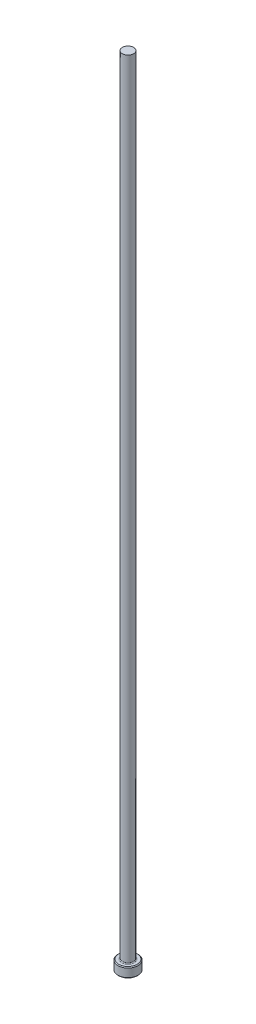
ISO-10303-21;
HEADER;
FILE_DESCRIPTION(('STEP AP214'),'2;1');
FILE_NAME('part.step','',(''),(''),'','','');
FILE_SCHEMA(('AUTOMOTIVE_DESIGN { 1 0 10303 214 1 1 1 1 }'));
ENDSEC;
DATA;
#1=APPLICATION_CONTEXT('core data for automotive mechanical design processes');
#2=APPLICATION_PROTOCOL_DEFINITION('international standard','automotive_design',2000,#1);
#3=PRODUCT_CONTEXT('',#1,'mechanical');
#4=PRODUCT('Part','Part','',(#3));
#5=PRODUCT_RELATED_PRODUCT_CATEGORY('part','',(#4));
#6=PRODUCT_DEFINITION_FORMATION('','',#4);
#7=PRODUCT_DEFINITION_CONTEXT('part definition',#1,'design');
#8=PRODUCT_DEFINITION('design','',#6,#7);
#9=PRODUCT_DEFINITION_SHAPE('','',#8);
#10=(LENGTH_UNIT() NAMED_UNIT(*) SI_UNIT(.MILLI.,.METRE.));
#11=(NAMED_UNIT(*) PLANE_ANGLE_UNIT() SI_UNIT($,.RADIAN.));
#12=(NAMED_UNIT(*) SI_UNIT($,.STERADIAN.) SOLID_ANGLE_UNIT());
#13=UNCERTAINTY_MEASURE_WITH_UNIT(LENGTH_MEASURE(1.E-05),#10,'distance_accuracy_value','');
#14=(GEOMETRIC_REPRESENTATION_CONTEXT(3) GLOBAL_UNCERTAINTY_ASSIGNED_CONTEXT((#13)) GLOBAL_UNIT_ASSIGNED_CONTEXT((#10,
#11,#12)) REPRESENTATION_CONTEXT('',''));
#15=CARTESIAN_POINT('',(0.,0.,0.));
#16=DIRECTION('',(0.,0.,1.));
#17=DIRECTION('',(1.,0.,0.));
#18=AXIS2_PLACEMENT_3D('',#15,#16,#17);
#19=CARTESIAN_POINT('',(0.,0.,0.));
#20=DIRECTION('',(0.,-1.,0.));
#21=DIRECTION('',(0.,0.,-1.));
#22=AXIS2_PLACEMENT_3D('',#19,#20,#21);
#23=PLANE('',#22);
#24=CARTESIAN_POINT('',(0.,0.,0.));
#25=DIRECTION('',(0.,-1.,0.));
#26=DIRECTION('',(0.,0.,-1.));
#27=AXIS2_PLACEMENT_3D('',#24,#25,#26);
#28=CIRCLE('',#27,2.92099999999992);
#29=CARTESIAN_POINT('',(0.,0.,-2.92099999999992));
#30=VERTEX_POINT('',#29);
#31=EDGE_CURVE('E46',#30,#30,#28,.T.);
#32=ORIENTED_EDGE('',*,*,#31,.T.);
#33=EDGE_LOOP('',(#32));
#34=FACE_BOUND('',#33,.T.);
#35=ADVANCED_FACE('F35',(#34),#23,.T.);
#36=CARTESIAN_POINT('',(0.,259.958771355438,0.));
#37=DIRECTION('',(0.,1.,0.));
#38=DIRECTION('',(0.,0.,1.));
#39=AXIS2_PLACEMENT_3D('',#36,#37,#38);
#40=CYLINDRICAL_SURFACE('',#39,3.17499999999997);
#41=CARTESIAN_POINT('',(0.,2.92100000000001,0.));
#42=DIRECTION('',(0.,1.,0.));
#43=DIRECTION('',(0.,0.,1.));
#44=AXIS2_PLACEMENT_3D('',#41,#42,#43);
#45=CIRCLE('',#44,3.17499999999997);
#46=CARTESIAN_POINT('',(0.,2.92100000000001,3.17499999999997));
#47=VERTEX_POINT('',#46);
#48=EDGE_CURVE('E50',#47,#47,#45,.F.);
#49=ORIENTED_EDGE('',*,*,#48,.T.);
#50=EDGE_LOOP('',(#49));
#51=FACE_BOUND('',#50,.T.);
#52=CARTESIAN_POINT('',(0.,0.254000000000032,0.));
#53=DIRECTION('',(0.,-1.,0.));
#54=DIRECTION('',(0.,0.,-1.));
#55=AXIS2_PLACEMENT_3D('',#52,#53,#54);
#56=CIRCLE('',#55,3.17499999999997);
#57=CARTESIAN_POINT('',(0.,0.254000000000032,-3.17499999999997));
#58=VERTEX_POINT('',#57);
#59=EDGE_CURVE('E55',#58,#58,#56,.F.);
#60=ORIENTED_EDGE('',*,*,#59,.T.);
#61=EDGE_LOOP('',(#60));
#62=FACE_BOUND('',#61,.T.);
#63=ADVANCED_FACE('F77',(#51,#62),#40,.T.);
#64=CARTESIAN_POINT('',(-3.17499999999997,3.175,0.));
#65=DIRECTION('',(0.,1.,0.));
#66=DIRECTION('',(0.,0.,1.));
#67=AXIS2_PLACEMENT_3D('',#64,#65,#66);
#68=PLANE('',#67);
#69=CARTESIAN_POINT('',(0.,3.175,0.));
#70=DIRECTION('',(0.,1.,0.));
#71=DIRECTION('',(0.,0.,1.));
#72=AXIS2_PLACEMENT_3D('',#69,#70,#71);
#73=CIRCLE('',#72,2.03961999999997);
#74=CARTESIAN_POINT('',(0.,3.175,2.03961999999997));
#75=VERTEX_POINT('',#74);
#76=EDGE_CURVE('E10',#75,#75,#73,.F.);
#77=ORIENTED_EDGE('',*,*,#76,.T.);
#78=EDGE_LOOP('',(#77));
#79=FACE_BOUND('',#78,.T.);
#80=CARTESIAN_POINT('',(0.,3.175,0.));
#81=DIRECTION('',(0.,1.,0.));
#82=DIRECTION('',(0.,0.,1.));
#83=AXIS2_PLACEMENT_3D('',#80,#81,#82);
#84=CIRCLE('',#83,2.92099999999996);
#85=CARTESIAN_POINT('',(0.,3.175,2.92099999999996));
#86=VERTEX_POINT('',#85);
#87=EDGE_CURVE('E58',#86,#86,#84,.T.);
#88=ORIENTED_EDGE('',*,*,#87,.T.);
#89=EDGE_LOOP('',(#88));
#90=FACE_BOUND('',#89,.T.);
#91=ADVANCED_FACE('F69',(#79,#90),#68,.T.);
#92=CARTESIAN_POINT('',(0.,259.958771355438,0.));
#93=DIRECTION('',(0.,1.,0.));
#94=DIRECTION('',(0.,0.,1.));
#95=AXIS2_PLACEMENT_3D('',#92,#93,#94);
#96=CYLINDRICAL_SURFACE('',#95,1.78561999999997);
#97=CARTESIAN_POINT('',(0.,3.42900000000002,0.));
#98=DIRECTION('',(0.,1.,0.));
#99=DIRECTION('',(0.,0.,1.));
#100=AXIS2_PLACEMENT_3D('',#97,#98,#99);
#101=CIRCLE('',#100,1.78561999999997);
#102=CARTESIAN_POINT('',(0.,3.42900000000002,1.78561999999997));
#103=VERTEX_POINT('',#102);
#104=EDGE_CURVE('E42',#103,#103,#101,.T.);
#105=ORIENTED_EDGE('',*,*,#104,.T.);
#106=EDGE_LOOP('',(#105));
#107=FACE_BOUND('',#106,.T.);
#108=CARTESIAN_POINT('',(0.,254.,0.));
#109=DIRECTION('',(0.,1.,0.));
#110=DIRECTION('',(0.,0.,1.));
#111=AXIS2_PLACEMENT_3D('',#108,#109,#110);
#112=CIRCLE('',#111,1.78561999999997);
#113=CARTESIAN_POINT('',(0.,254.,1.78561999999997));
#114=VERTEX_POINT('',#113);
#115=EDGE_CURVE('E61',#114,#114,#112,.T.);
#116=ORIENTED_EDGE('',*,*,#115,.F.);
#117=EDGE_LOOP('',(#116));
#118=FACE_BOUND('',#117,.T.);
#119=ADVANCED_FACE('F67',(#107,#118),#96,.T.);
#120=CARTESIAN_POINT('',(-1.78561999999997,254.,0.));
#121=DIRECTION('',(0.,1.,0.));
#122=DIRECTION('',(0.,0.,1.));
#123=AXIS2_PLACEMENT_3D('',#120,#121,#122);
#124=PLANE('',#123);
#125=ORIENTED_EDGE('',*,*,#115,.T.);
#126=EDGE_LOOP('',(#125));
#127=FACE_BOUND('',#126,.T.);
#128=ADVANCED_FACE('F65',(#127),#124,.T.);
#129=CARTESIAN_POINT('',(0.,3.17499999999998,0.));
#130=DIRECTION('',(0.,-1.,0.));
#131=DIRECTION('',(0.,0.,-1.));
#132=AXIS2_PLACEMENT_3D('',#129,#130,#131);
#133=CONICAL_SURFACE('',#132,2.92099999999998,0.785398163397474);
#134=ORIENTED_EDGE('',*,*,#48,.F.);
#135=EDGE_LOOP('',(#134));
#136=FACE_BOUND('',#135,.T.);
#137=ORIENTED_EDGE('',*,*,#87,.F.);
#138=EDGE_LOOP('',(#137));
#139=FACE_BOUND('',#138,.T.);
#140=ADVANCED_FACE('F75',(#136,#139),#133,.T.);
#141=CARTESIAN_POINT('',(0.,0.254000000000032,0.));
#142=DIRECTION('',(0.,1.,0.));
#143=DIRECTION('',(0.,0.,1.));
#144=AXIS2_PLACEMENT_3D('',#141,#142,#143);
#145=CONICAL_SURFACE('',#144,3.17499999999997,0.785398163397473);
#146=ORIENTED_EDGE('',*,*,#31,.F.);
#147=EDGE_LOOP('',(#146));
#148=FACE_BOUND('',#147,.T.);
#149=ORIENTED_EDGE('',*,*,#59,.F.);
#150=EDGE_LOOP('',(#149));
#151=FACE_BOUND('',#150,.T.);
#152=ADVANCED_FACE('F89',(#148,#151),#145,.T.);
#153=CARTESIAN_POINT('',(0.,3.42900000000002,0.));
#154=DIRECTION('',(0.,1.,0.));
#155=DIRECTION('',(0.,0.,1.));
#156=AXIS2_PLACEMENT_3D('',#153,#154,#155);
#157=TOROIDAL_SURFACE('',#156,2.03961999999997,0.254);
#158=ORIENTED_EDGE('',*,*,#76,.F.);
#159=EDGE_LOOP('',(#158));
#160=FACE_BOUND('',#159,.T.);
#161=ORIENTED_EDGE('',*,*,#104,.F.);
#162=EDGE_LOOP('',(#161));
#163=FACE_BOUND('',#162,.T.);
#164=ADVANCED_FACE('F37',(#160,#163),#157,.F.);
#165=CLOSED_SHELL('',(#35,#63,#91,#119,#128,#140,#152,#164));
#166=MANIFOLD_SOLID_BREP('B2',#165);
#167=ADVANCED_BREP_SHAPE_REPRESENTATION('',(#18,#166),#14);
#168=SHAPE_DEFINITION_REPRESENTATION(#9,#167);
ENDSEC;
END-ISO-10303-21;
